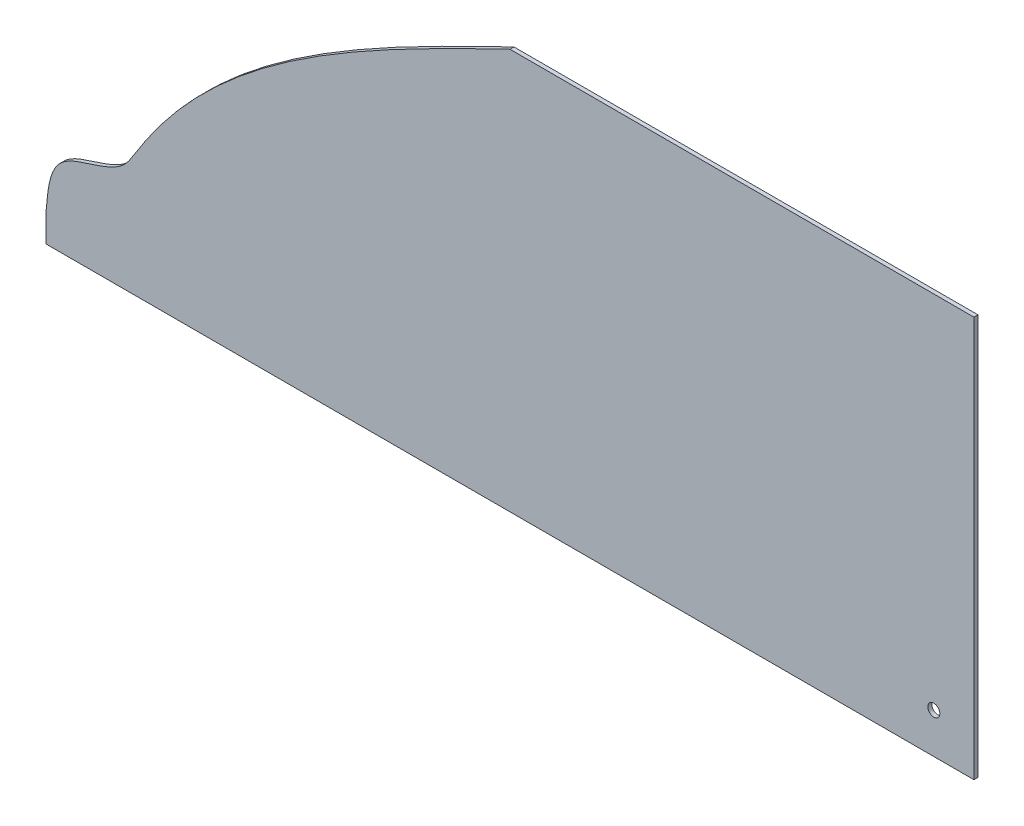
ISO-10303-21;
HEADER;
FILE_DESCRIPTION(('STEP AP214'),'2;1');
FILE_NAME('part.step','',(''),(''),'','','');
FILE_SCHEMA(('AUTOMOTIVE_DESIGN { 1 0 10303 214 1 1 1 1 }'));
ENDSEC;
DATA;
#1=APPLICATION_CONTEXT('core data for automotive mechanical design processes');
#2=APPLICATION_PROTOCOL_DEFINITION('international standard','automotive_design',2000,#1);
#3=PRODUCT_CONTEXT('',#1,'mechanical');
#4=PRODUCT('Part','Part','',(#3));
#5=PRODUCT_RELATED_PRODUCT_CATEGORY('part','',(#4));
#6=PRODUCT_DEFINITION_FORMATION('','',#4);
#7=PRODUCT_DEFINITION_CONTEXT('part definition',#1,'design');
#8=PRODUCT_DEFINITION('design','',#6,#7);
#9=PRODUCT_DEFINITION_SHAPE('','',#8);
#10=(LENGTH_UNIT() NAMED_UNIT(*) SI_UNIT(.MILLI.,.METRE.));
#11=(NAMED_UNIT(*) PLANE_ANGLE_UNIT() SI_UNIT($,.RADIAN.));
#12=(NAMED_UNIT(*) SI_UNIT($,.STERADIAN.) SOLID_ANGLE_UNIT());
#13=UNCERTAINTY_MEASURE_WITH_UNIT(LENGTH_MEASURE(1.E-05),#10,'distance_accuracy_value','');
#14=(GEOMETRIC_REPRESENTATION_CONTEXT(3) GLOBAL_UNCERTAINTY_ASSIGNED_CONTEXT((#13)) GLOBAL_UNIT_ASSIGNED_CONTEXT((#10,
#11,#12)) REPRESENTATION_CONTEXT('',''));
#15=CARTESIAN_POINT('',(0.,0.,0.));
#16=DIRECTION('',(0.,0.,1.));
#17=DIRECTION('',(1.,0.,0.));
#18=AXIS2_PLACEMENT_3D('',#15,#16,#17);
#19=CARTESIAN_POINT('',(230.980836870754,0.,1.));
#20=DIRECTION('',(0.,0.,1.));
#21=DIRECTION('',(1.,0.,0.));
#22=AXIS2_PLACEMENT_3D('',#19,#20,#21);
#23=PLANE('',#22);
#24=CARTESIAN_POINT('',(220.980836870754,10.,1.));
#25=DIRECTION('',(0.,0.,1.));
#26=DIRECTION('',(1.,0.,0.));
#27=AXIS2_PLACEMENT_3D('',#24,#25,#26);
#28=CIRCLE('',#27,1.5);
#29=CARTESIAN_POINT('',(222.480836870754,10.,1.));
#30=VERTEX_POINT('',#29);
#31=EDGE_CURVE('E109',#30,#30,#28,.T.);
#32=ORIENTED_EDGE('',*,*,#31,.F.);
#33=EDGE_LOOP('',(#32));
#34=FACE_BOUND('',#33,.T.);
#35=DIRECTION('',(-1.,0.,0.));
#36=VECTOR('',#35,1.);
#37=CARTESIAN_POINT('',(230.980836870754,99.7199552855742,1.));
#38=LINE('',#37,#36);
#39=CARTESIAN_POINT('',(230.980836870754,99.7199552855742,1.));
#40=VERTEX_POINT('',#39);
#41=CARTESIAN_POINT('',(115.490418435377,99.7199552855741,1.));
#42=VERTEX_POINT('',#41);
#43=EDGE_CURVE('E89',#40,#42,#38,.T.);
#44=ORIENTED_EDGE('',*,*,#43,.T.);
#45=CARTESIAN_POINT('',(0.,6.92849902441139,1.));
#46=CARTESIAN_POINT('',(0.3953796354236,11.6218181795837,1.));
#47=CARTESIAN_POINT('',(1.34324015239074,22.8733130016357,1.));
#48=CARTESIAN_POINT('',(17.5745045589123,22.7201243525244,1.));
#49=CARTESIAN_POINT('',(41.386338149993,63.7269039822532,1.));
#50=CARTESIAN_POINT('',(79.3311119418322,82.1570387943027,1.));
#51=CARTESIAN_POINT('',(115.490418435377,99.7199552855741,1.));
#52=B_SPLINE_CURVE_WITH_KNOTS('',3,(#45,#46,#47,#48,#49,#50,#51),.UNSPECIFIED.,.F.,.F.,(4,1,1,1,
4),(0.,0.0830954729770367,0.199208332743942,0.236889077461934,1.),.UNSPECIFIED.);
#53=CARTESIAN_POINT('',(0.,6.92849902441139,1.));
#54=VERTEX_POINT('',#53);
#55=EDGE_CURVE('E92',#42,#54,#52,.F.);
#56=ORIENTED_EDGE('',*,*,#55,.T.);
#57=DIRECTION('',(0.,-1.,0.));
#58=VECTOR('',#57,1.);
#59=CARTESIAN_POINT('',(0.,0.,1.));
#60=LINE('',#59,#58);
#61=CARTESIAN_POINT('',(0.,0.,1.));
#62=VERTEX_POINT('',#61);
#63=EDGE_CURVE('E81',#54,#62,#60,.T.);
#64=ORIENTED_EDGE('',*,*,#63,.T.);
#65=DIRECTION('',(1.,0.,0.));
#66=VECTOR('',#65,1.);
#67=CARTESIAN_POINT('',(230.980836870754,0.,1.));
#68=LINE('',#67,#66);
#69=CARTESIAN_POINT('',(230.980836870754,0.,1.));
#70=VERTEX_POINT('',#69);
#71=EDGE_CURVE('E88',#62,#70,#68,.T.);
#72=ORIENTED_EDGE('',*,*,#71,.T.);
#73=DIRECTION('',(0.,1.,0.));
#74=VECTOR('',#73,1.);
#75=CARTESIAN_POINT('',(230.980836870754,0.,1.));
#76=LINE('',#75,#74);
#77=EDGE_CURVE('E118',#70,#40,#76,.T.);
#78=ORIENTED_EDGE('',*,*,#77,.T.);
#79=EDGE_LOOP('',(#44,#56,#64,#72,#78));
#80=FACE_BOUND('',#79,.T.);
#81=ADVANCED_FACE('F34',(#34,#80),#23,.T.);
#82=CARTESIAN_POINT('',(230.980836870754,0.,0.));
#83=DIRECTION('',(0.,0.,1.));
#84=DIRECTION('',(1.,0.,0.));
#85=AXIS2_PLACEMENT_3D('',#82,#83,#84);
#86=PLANE('',#85);
#87=CARTESIAN_POINT('',(220.980836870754,10.,0.));
#88=DIRECTION('',(0.,0.,1.));
#89=DIRECTION('',(1.,0.,0.));
#90=AXIS2_PLACEMENT_3D('',#87,#88,#89);
#91=CIRCLE('',#90,1.5);
#92=CARTESIAN_POINT('',(222.480836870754,10.,0.));
#93=VERTEX_POINT('',#92);
#94=EDGE_CURVE('E95',#93,#93,#91,.T.);
#95=ORIENTED_EDGE('',*,*,#94,.T.);
#96=EDGE_LOOP('',(#95));
#97=FACE_BOUND('',#96,.T.);
#98=CARTESIAN_POINT('',(0.,6.92849902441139,0.));
#99=CARTESIAN_POINT('',(0.3953796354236,11.6218181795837,0.));
#100=CARTESIAN_POINT('',(1.34324015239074,22.8733130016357,0.));
#101=CARTESIAN_POINT('',(17.5745045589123,22.7201243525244,0.));
#102=CARTESIAN_POINT('',(41.386338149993,63.7269039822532,0.));
#103=CARTESIAN_POINT('',(79.3311119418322,82.1570387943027,0.));
#104=CARTESIAN_POINT('',(115.490418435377,99.7199552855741,0.));
#105=B_SPLINE_CURVE_WITH_KNOTS('',3,(#98,#99,#100,#101,#102,#103,#104),.UNSPECIFIED.,.F.,.F.,(4,
1,1,1,4),(0.,0.0830954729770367,0.199208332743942,0.236889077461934,1.),.UNSPECIFIED.);
#106=CARTESIAN_POINT('',(115.490418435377,99.7199552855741,0.));
#107=VERTEX_POINT('',#106);
#108=CARTESIAN_POINT('',(0.,6.92849902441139,0.));
#109=VERTEX_POINT('',#108);
#110=EDGE_CURVE('E57',#107,#109,#105,.F.);
#111=ORIENTED_EDGE('',*,*,#110,.F.);
#112=DIRECTION('',(-1.,0.,0.));
#113=VECTOR('',#112,1.);
#114=CARTESIAN_POINT('',(230.980836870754,99.7199552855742,0.));
#115=LINE('',#114,#113);
#116=CARTESIAN_POINT('',(230.980836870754,99.7199552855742,0.));
#117=VERTEX_POINT('',#116);
#118=EDGE_CURVE('E126',#117,#107,#115,.T.);
#119=ORIENTED_EDGE('',*,*,#118,.F.);
#120=DIRECTION('',(0.,1.,0.));
#121=VECTOR('',#120,1.);
#122=CARTESIAN_POINT('',(230.980836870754,0.,0.));
#123=LINE('',#122,#121);
#124=CARTESIAN_POINT('',(230.980836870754,0.,0.));
#125=VERTEX_POINT('',#124);
#126=EDGE_CURVE('E115',#125,#117,#123,.T.);
#127=ORIENTED_EDGE('',*,*,#126,.F.);
#128=DIRECTION('',(1.,0.,0.));
#129=VECTOR('',#128,1.);
#130=CARTESIAN_POINT('',(230.980836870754,0.,0.));
#131=LINE('',#130,#129);
#132=CARTESIAN_POINT('',(0.,0.,0.));
#133=VERTEX_POINT('',#132);
#134=EDGE_CURVE('E120',#133,#125,#131,.T.);
#135=ORIENTED_EDGE('',*,*,#134,.F.);
#136=DIRECTION('',(0.,-1.,0.));
#137=VECTOR('',#136,1.);
#138=CARTESIAN_POINT('',(0.,0.,0.));
#139=LINE('',#138,#137);
#140=EDGE_CURVE('E128',#109,#133,#139,.T.);
#141=ORIENTED_EDGE('',*,*,#140,.F.);
#142=EDGE_LOOP('',(#111,#119,#127,#135,#141));
#143=FACE_BOUND('',#142,.T.);
#144=ADVANCED_FACE('F141',(#97,#143),#86,.F.);
#145=CARTESIAN_POINT('',(230.980836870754,99.7199552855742,1.));
#146=DIRECTION('',(0.,-1.,0.));
#147=DIRECTION('',(1.,0.,0.));
#148=AXIS2_PLACEMENT_3D('',#145,#146,#147);
#149=PLANE('',#148);
#150=DIRECTION('',(0.,0.,-1.));
#151=VECTOR('',#150,1.);
#152=CARTESIAN_POINT('',(115.490418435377,99.7199552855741,315.486725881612));
#153=LINE('',#152,#151);
#154=EDGE_CURVE('E49',#42,#107,#153,.T.);
#155=ORIENTED_EDGE('',*,*,#154,.F.);
#156=ORIENTED_EDGE('',*,*,#43,.F.);
#157=DIRECTION('',(0.,0.,-1.));
#158=VECTOR('',#157,1.);
#159=CARTESIAN_POINT('',(230.980836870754,99.7199552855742,1.));
#160=LINE('',#159,#158);
#161=EDGE_CURVE('E42',#40,#117,#160,.T.);
#162=ORIENTED_EDGE('',*,*,#161,.T.);
#163=ORIENTED_EDGE('',*,*,#118,.T.);
#164=EDGE_LOOP('',(#155,#156,#162,#163));
#165=FACE_BOUND('',#164,.T.);
#166=ADVANCED_FACE('F135',(#165),#149,.F.);
#167=CARTESIAN_POINT('',(0.,0.,1.));
#168=DIRECTION('',(1.,0.,0.));
#169=DIRECTION('',(0.,0.,-1.));
#170=AXIS2_PLACEMENT_3D('',#167,#168,#169);
#171=PLANE('',#170);
#172=DIRECTION('',(0.,0.,-1.));
#173=VECTOR('',#172,1.);
#174=CARTESIAN_POINT('',(0.,6.92849902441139,315.486725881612));
#175=LINE('',#174,#173);
#176=EDGE_CURVE('E11',#109,#54,#175,.F.);
#177=ORIENTED_EDGE('',*,*,#176,.F.);
#178=ORIENTED_EDGE('',*,*,#140,.T.);
#179=DIRECTION('',(0.,0.,-1.));
#180=VECTOR('',#179,1.);
#181=CARTESIAN_POINT('',(0.,0.,1.));
#182=LINE('',#181,#180);
#183=EDGE_CURVE('E85',#62,#133,#182,.T.);
#184=ORIENTED_EDGE('',*,*,#183,.F.);
#185=ORIENTED_EDGE('',*,*,#63,.F.);
#186=EDGE_LOOP('',(#177,#178,#184,#185));
#187=FACE_BOUND('',#186,.T.);
#188=ADVANCED_FACE('F83',(#187),#171,.F.);
#189=CARTESIAN_POINT('',(230.980836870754,0.,1.));
#190=DIRECTION('',(-1.,0.,0.));
#191=DIRECTION('',(0.,0.,1.));
#192=AXIS2_PLACEMENT_3D('',#189,#190,#191);
#193=PLANE('',#192);
#194=ORIENTED_EDGE('',*,*,#126,.T.);
#195=ORIENTED_EDGE('',*,*,#161,.F.);
#196=ORIENTED_EDGE('',*,*,#77,.F.);
#197=DIRECTION('',(0.,0.,-1.));
#198=VECTOR('',#197,1.);
#199=CARTESIAN_POINT('',(230.980836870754,0.,1.));
#200=LINE('',#199,#198);
#201=EDGE_CURVE('E123',#70,#125,#200,.T.);
#202=ORIENTED_EDGE('',*,*,#201,.T.);
#203=EDGE_LOOP('',(#194,#195,#196,#202));
#204=FACE_BOUND('',#203,.T.);
#205=ADVANCED_FACE('F36',(#204),#193,.F.);
#206=CARTESIAN_POINT('',(230.980836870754,0.,1.));
#207=DIRECTION('',(0.,1.,0.));
#208=DIRECTION('',(-1.,0.,0.));
#209=AXIS2_PLACEMENT_3D('',#206,#207,#208);
#210=PLANE('',#209);
#211=ORIENTED_EDGE('',*,*,#134,.T.);
#212=ORIENTED_EDGE('',*,*,#201,.F.);
#213=ORIENTED_EDGE('',*,*,#71,.F.);
#214=ORIENTED_EDGE('',*,*,#183,.T.);
#215=EDGE_LOOP('',(#211,#212,#213,#214));
#216=FACE_BOUND('',#215,.T.);
#217=ADVANCED_FACE('F143',(#216),#210,.F.);
#218=CARTESIAN_POINT('',(220.980836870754,10.,1.));
#219=DIRECTION('',(0.,0.,-1.));
#220=DIRECTION('',(-1.,0.,0.));
#221=AXIS2_PLACEMENT_3D('',#218,#219,#220);
#222=CYLINDRICAL_SURFACE('',#221,1.5);
#223=ORIENTED_EDGE('',*,*,#31,.T.);
#224=EDGE_LOOP('',(#223));
#225=FACE_BOUND('',#224,.T.);
#226=ORIENTED_EDGE('',*,*,#94,.F.);
#227=EDGE_LOOP('',(#226));
#228=FACE_BOUND('',#227,.T.);
#229=ADVANCED_FACE('F145',(#225,#228),#222,.F.);
#230=CARTESIAN_POINT('',(0.,6.92849902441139,315.486725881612));
#231=CARTESIAN_POINT('',(0.3953796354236,11.6218181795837,315.486725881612));
#232=CARTESIAN_POINT('',(1.34324015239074,22.8733130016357,315.486725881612));
#233=CARTESIAN_POINT('',(17.5745045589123,22.7201243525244,315.486725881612));
#234=CARTESIAN_POINT('',(41.386338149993,63.7269039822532,315.486725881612));
#235=CARTESIAN_POINT('',(79.3311119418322,82.1570387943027,315.486725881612));
#236=CARTESIAN_POINT('',(115.490418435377,99.7199552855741,315.486725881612));
#237=B_SPLINE_CURVE_WITH_KNOTS('',3,(#230,#231,#232,#233,#234,#235,#236),.UNSPECIFIED.,.F.,.F.,
(4,1,1,1,4),(0.,0.0830954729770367,0.199208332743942,0.236889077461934,1.),.UNSPECIFIED.);
#238=DIRECTION('',(0.,0.,-1.));
#239=VECTOR('',#238,1.);
#240=SURFACE_OF_LINEAR_EXTRUSION('',#237,#239);
#241=ORIENTED_EDGE('',*,*,#55,.F.);
#242=ORIENTED_EDGE('',*,*,#154,.T.);
#243=ORIENTED_EDGE('',*,*,#110,.T.);
#244=ORIENTED_EDGE('',*,*,#176,.T.);
#245=EDGE_LOOP('',(#241,#242,#243,#244));
#246=FACE_BOUND('',#245,.T.);
#247=ADVANCED_FACE('F97',(#246),#240,.T.);
#248=CLOSED_SHELL('',(#81,#144,#166,#188,#205,#217,#229,#247));
#249=MANIFOLD_SOLID_BREP('B2',#248);
#250=ADVANCED_BREP_SHAPE_REPRESENTATION('',(#18,#249),#14);
#251=SHAPE_DEFINITION_REPRESENTATION(#9,#250);
ENDSEC;
END-ISO-10303-21;
